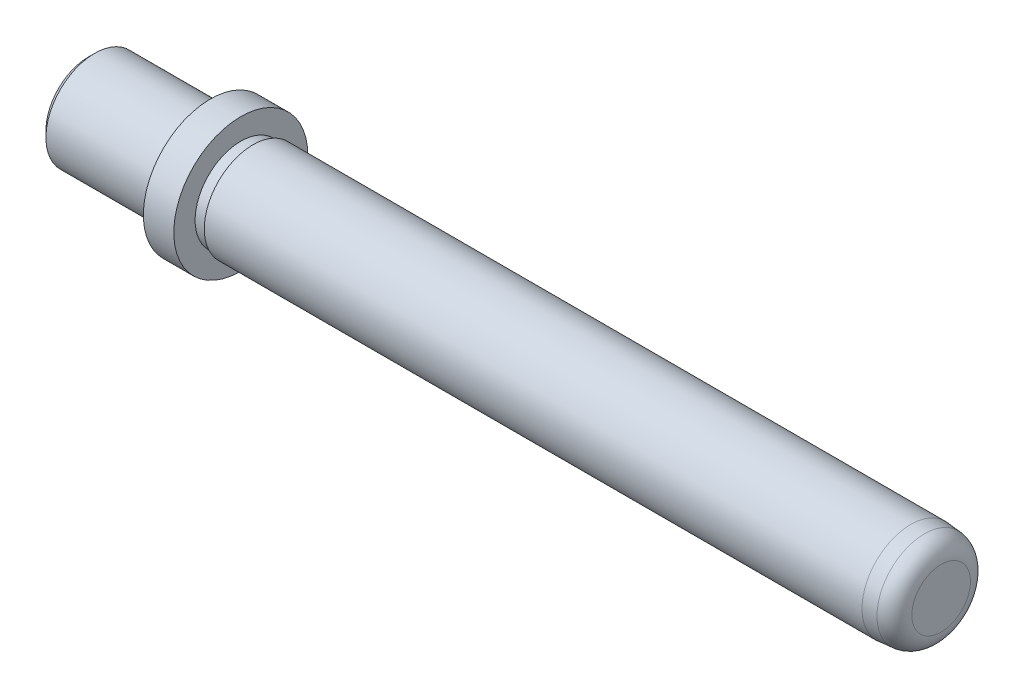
ISO-10303-21;
HEADER;
FILE_DESCRIPTION(('STEP AP214'),'2;1');
FILE_NAME('part.step','',(''),(''),'','','');
FILE_SCHEMA(('AUTOMOTIVE_DESIGN { 1 0 10303 214 1 1 1 1 }'));
ENDSEC;
DATA;
#1=APPLICATION_CONTEXT('core data for automotive mechanical design processes');
#2=APPLICATION_PROTOCOL_DEFINITION('international standard','automotive_design',2000,#1);
#3=PRODUCT_CONTEXT('',#1,'mechanical');
#4=PRODUCT('Part','Part','',(#3));
#5=PRODUCT_RELATED_PRODUCT_CATEGORY('part','',(#4));
#6=PRODUCT_DEFINITION_FORMATION('','',#4);
#7=PRODUCT_DEFINITION_CONTEXT('part definition',#1,'design');
#8=PRODUCT_DEFINITION('design','',#6,#7);
#9=PRODUCT_DEFINITION_SHAPE('','',#8);
#10=(LENGTH_UNIT() NAMED_UNIT(*) SI_UNIT(.MILLI.,.METRE.));
#11=(NAMED_UNIT(*) PLANE_ANGLE_UNIT() SI_UNIT($,.RADIAN.));
#12=(NAMED_UNIT(*) SI_UNIT($,.STERADIAN.) SOLID_ANGLE_UNIT());
#13=UNCERTAINTY_MEASURE_WITH_UNIT(LENGTH_MEASURE(1.E-05),#10,'distance_accuracy_value','');
#14=(GEOMETRIC_REPRESENTATION_CONTEXT(3) GLOBAL_UNCERTAINTY_ASSIGNED_CONTEXT((#13)) GLOBAL_UNIT_ASSIGNED_CONTEXT((#10,
#11,#12)) REPRESENTATION_CONTEXT('',''));
#15=CARTESIAN_POINT('',(0.,0.,0.));
#16=DIRECTION('',(0.,0.,1.));
#17=DIRECTION('',(1.,0.,0.));
#18=AXIS2_PLACEMENT_3D('',#15,#16,#17);
#19=CARTESIAN_POINT('',(24.3886339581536,19.5804059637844,0.));
#20=DIRECTION('',(-1.,0.,0.));
#21=DIRECTION('',(0.,0.,1.));
#22=AXIS2_PLACEMENT_3D('',#19,#20,#21);
#23=CONICAL_SURFACE('',#22,3.32349999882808,1.02974425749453);
#24=CARTESIAN_POINT('',(26.3855942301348,19.5804059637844,0.));
#25=VERTEX_POINT('',#24);
#26=VERTEX_LOOP('',#25);
#27=FACE_BOUND('',#26,.T.);
#28=CARTESIAN_POINT('',(24.3886339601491,19.5804059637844,0.));
#29=DIRECTION('',(-1.,0.,0.));
#30=DIRECTION('',(0.,0.,1.));
#31=AXIS2_PLACEMENT_3D('',#28,#29,#30);
#32=CIRCLE('',#31,3.3235);
#33=CARTESIAN_POINT('',(24.3886339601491,19.5804059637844,3.3235));
#34=VERTEX_POINT('',#33);
#35=EDGE_CURVE('E33',#34,#34,#32,.T.);
#36=ORIENTED_EDGE('',*,*,#35,.T.);
#37=EDGE_LOOP('',(#36));
#38=FACE_BOUND('',#37,.T.);
#39=ADVANCED_FACE('F17',(#27,#38),#23,.F.);
#40=CARTESIAN_POINT('',(12.3886339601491,19.5804059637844,0.));
#41=DIRECTION('',(-1.,0.,0.));
#42=DIRECTION('',(0.,0.,1.));
#43=AXIS2_PLACEMENT_3D('',#40,#41,#42);
#44=CYLINDRICAL_SURFACE('',#43,3.3235);
#45=ORIENTED_EDGE('',*,*,#35,.F.);
#46=EDGE_LOOP('',(#45));
#47=FACE_BOUND('',#46,.T.);
#48=CARTESIAN_POINT('',(0.38863396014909,19.5804059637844,0.));
#49=DIRECTION('',(-1.,0.,0.));
#50=DIRECTION('',(0.,0.,1.));
#51=AXIS2_PLACEMENT_3D('',#48,#49,#50);
#52=CIRCLE('',#51,3.3235);
#53=CARTESIAN_POINT('',(0.38863396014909,19.5804059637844,3.3235));
#54=VERTEX_POINT('',#53);
#55=EDGE_CURVE('E20',#54,#54,#52,.F.);
#56=ORIENTED_EDGE('',*,*,#55,.F.);
#57=EDGE_LOOP('',(#56));
#58=FACE_BOUND('',#57,.T.);
#59=ADVANCED_FACE('F30',(#47,#58),#44,.F.);
#60=CARTESIAN_POINT('',(0.38863396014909,23.0804059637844,0.));
#61=DIRECTION('',(-1.,0.,0.));
#62=DIRECTION('',(0.,0.,1.));
#63=AXIS2_PLACEMENT_3D('',#60,#61,#62);
#64=PLANE('',#63);
#65=ORIENTED_EDGE('',*,*,#55,.T.);
#66=EDGE_LOOP('',(#65));
#67=FACE_BOUND('',#66,.T.);
#68=CARTESIAN_POINT('',(0.388633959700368,19.5804059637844,0.));
#69=DIRECTION('',(1.,0.,0.));
#70=DIRECTION('',(0.,0.,-1.));
#71=AXIS2_PLACEMENT_3D('',#68,#69,#70);
#72=CIRCLE('',#71,7.0000000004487);
#73=CARTESIAN_POINT('',(0.388633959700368,19.5804059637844,-7.0000000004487));
#74=VERTEX_POINT('',#73);
#75=EDGE_CURVE('E37',#74,#74,#72,.T.);
#76=ORIENTED_EDGE('',*,*,#75,.F.);
#77=EDGE_LOOP('',(#76));
#78=FACE_BOUND('',#77,.T.);
#79=ADVANCED_FACE('F136',(#67,#78),#64,.T.);
#80=CARTESIAN_POINT('',(1.38863396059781,19.5804059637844,0.));
#81=DIRECTION('',(1.,0.,0.));
#82=DIRECTION('',(0.,0.,-1.));
#83=AXIS2_PLACEMENT_3D('',#80,#81,#82);
#84=CONICAL_SURFACE('',#83,7.99999999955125,0.785398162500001);
#85=ORIENTED_EDGE('',*,*,#75,.T.);
#86=EDGE_LOOP('',(#85));
#87=FACE_BOUND('',#86,.T.);
#88=CARTESIAN_POINT('',(1.38863396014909,19.5804059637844,0.));
#89=DIRECTION('',(1.,0.,0.));
#90=DIRECTION('',(0.,0.,-1.));
#91=AXIS2_PLACEMENT_3D('',#88,#89,#90);
#92=CIRCLE('',#91,7.99999999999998);
#93=CARTESIAN_POINT('',(1.38863396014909,19.5804059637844,-7.99999999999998));
#94=VERTEX_POINT('',#93);
#95=EDGE_CURVE('E66',#94,#94,#92,.T.);
#96=ORIENTED_EDGE('',*,*,#95,.F.);
#97=EDGE_LOOP('',(#96));
#98=FACE_BOUND('',#97,.T.);
#99=ADVANCED_FACE('F133',(#87,#98),#84,.T.);
#100=CARTESIAN_POINT('',(9.88863396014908,19.5804059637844,0.));
#101=DIRECTION('',(1.,0.,0.));
#102=DIRECTION('',(0.,0.,-1.));
#103=AXIS2_PLACEMENT_3D('',#100,#101,#102);
#104=CYLINDRICAL_SURFACE('',#103,7.99999999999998);
#105=ORIENTED_EDGE('',*,*,#95,.T.);
#106=EDGE_LOOP('',(#105));
#107=FACE_BOUND('',#106,.T.);
#108=CARTESIAN_POINT('',(18.3886339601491,19.5804059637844,0.));
#109=DIRECTION('',(1.,0.,0.));
#110=DIRECTION('',(0.,0.,-1.));
#111=AXIS2_PLACEMENT_3D('',#108,#109,#110);
#112=CIRCLE('',#111,7.99999999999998);
#113=CARTESIAN_POINT('',(18.3886339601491,19.5804059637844,-7.99999999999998));
#114=VERTEX_POINT('',#113);
#115=EDGE_CURVE('E64',#114,#114,#112,.T.);
#116=ORIENTED_EDGE('',*,*,#115,.F.);
#117=EDGE_LOOP('',(#116));
#118=FACE_BOUND('',#117,.T.);
#119=ADVANCED_FACE('F129',(#107,#118),#104,.T.);
#120=CARTESIAN_POINT('',(18.3886339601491,27.3304059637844,0.));
#121=DIRECTION('',(1.,0.,0.));
#122=DIRECTION('',(0.,0.,-1.));
#123=AXIS2_PLACEMENT_3D('',#120,#121,#122);
#124=PLANE('',#123);
#125=CARTESIAN_POINT('',(18.3886339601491,19.5804059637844,0.));
#126=DIRECTION('',(1.,0.,0.));
#127=DIRECTION('',(0.,0.,-1.));
#128=AXIS2_PLACEMENT_3D('',#125,#126,#127);
#129=CIRCLE('',#128,7.5);
#130=CARTESIAN_POINT('',(18.3886339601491,19.5804059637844,-7.5));
#131=VERTEX_POINT('',#130);
#132=EDGE_CURVE('E61',#131,#131,#129,.T.);
#133=ORIENTED_EDGE('',*,*,#132,.F.);
#134=EDGE_LOOP('',(#133));
#135=FACE_BOUND('',#134,.T.);
#136=ORIENTED_EDGE('',*,*,#115,.T.);
#137=EDGE_LOOP('',(#136));
#138=FACE_BOUND('',#137,.T.);
#139=ADVANCED_FACE('F125',(#135,#138),#124,.T.);
#140=CARTESIAN_POINT('',(19.3886339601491,19.5804059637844,0.));
#141=DIRECTION('',(1.,0.,0.));
#142=DIRECTION('',(0.,0.,-1.));
#143=AXIS2_PLACEMENT_3D('',#140,#141,#142);
#144=CYLINDRICAL_SURFACE('',#143,7.5);
#145=ORIENTED_EDGE('',*,*,#132,.T.);
#146=EDGE_LOOP('',(#145));
#147=FACE_BOUND('',#146,.T.);
#148=CARTESIAN_POINT('',(20.3886339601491,19.5804059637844,0.));
#149=DIRECTION('',(1.,0.,0.));
#150=DIRECTION('',(0.,0.,-1.));
#151=AXIS2_PLACEMENT_3D('',#148,#149,#150);
#152=CIRCLE('',#151,7.5);
#153=CARTESIAN_POINT('',(20.3886339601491,19.5804059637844,-7.5));
#154=VERTEX_POINT('',#153);
#155=EDGE_CURVE('E58',#154,#154,#152,.T.);
#156=ORIENTED_EDGE('',*,*,#155,.F.);
#157=EDGE_LOOP('',(#156));
#158=FACE_BOUND('',#157,.T.);
#159=ADVANCED_FACE('F121',(#147,#158),#144,.T.);
#160=CARTESIAN_POINT('',(20.3886339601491,28.8304059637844,0.));
#161=DIRECTION('',(-1.,0.,0.));
#162=DIRECTION('',(0.,0.,1.));
#163=AXIS2_PLACEMENT_3D('',#160,#161,#162);
#164=PLANE('',#163);
#165=ORIENTED_EDGE('',*,*,#155,.T.);
#166=EDGE_LOOP('',(#165));
#167=FACE_BOUND('',#166,.T.);
#168=CARTESIAN_POINT('',(20.3886339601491,19.5804059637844,0.));
#169=DIRECTION('',(1.,0.,0.));
#170=DIRECTION('',(0.,0.,-1.));
#171=AXIS2_PLACEMENT_3D('',#168,#169,#170);
#172=CIRCLE('',#171,11.);
#173=CARTESIAN_POINT('',(20.3886339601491,19.5804059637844,-11.));
#174=VERTEX_POINT('',#173);
#175=EDGE_CURVE('E55',#174,#174,#172,.T.);
#176=ORIENTED_EDGE('',*,*,#175,.F.);
#177=EDGE_LOOP('',(#176));
#178=FACE_BOUND('',#177,.T.);
#179=ADVANCED_FACE('F117',(#167,#178),#164,.T.);
#180=CARTESIAN_POINT('',(22.8886339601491,19.5804059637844,0.));
#181=DIRECTION('',(1.,0.,0.));
#182=DIRECTION('',(0.,0.,-1.));
#183=AXIS2_PLACEMENT_3D('',#180,#181,#182);
#184=CYLINDRICAL_SURFACE('',#183,11.);
#185=ORIENTED_EDGE('',*,*,#175,.T.);
#186=EDGE_LOOP('',(#185));
#187=FACE_BOUND('',#186,.T.);
#188=CARTESIAN_POINT('',(25.3886339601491,19.5804059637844,0.));
#189=DIRECTION('',(1.,0.,0.));
#190=DIRECTION('',(0.,0.,-1.));
#191=AXIS2_PLACEMENT_3D('',#188,#189,#190);
#192=CIRCLE('',#191,11.);
#193=CARTESIAN_POINT('',(25.3886339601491,19.5804059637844,-11.));
#194=VERTEX_POINT('',#193);
#195=EDGE_CURVE('E52',#194,#194,#192,.T.);
#196=ORIENTED_EDGE('',*,*,#195,.F.);
#197=EDGE_LOOP('',(#196));
#198=FACE_BOUND('',#197,.T.);
#199=ADVANCED_FACE('F114',(#187,#198),#184,.T.);
#200=CARTESIAN_POINT('',(140.388633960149,21.9871875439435,0.));
#201=DIRECTION('',(1.,0.,0.));
#202=DIRECTION('',(0.,0.,-1.));
#203=AXIS2_PLACEMENT_3D('',#200,#201,#202);
#204=PLANE('',#203);
#205=CARTESIAN_POINT('',(140.388633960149,19.5804059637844,0.));
#206=DIRECTION('',(-1.,0.,0.));
#207=DIRECTION('',(0.,1.,0.));
#208=AXIS2_PLACEMENT_3D('',#205,#206,#207);
#209=CIRCLE('',#208,4.81356316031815);
#210=CARTESIAN_POINT('',(140.388633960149,24.3939691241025,0.));
#211=VERTEX_POINT('',#210);
#212=EDGE_CURVE('E51',#211,#211,#209,.T.);
#213=ORIENTED_EDGE('',*,*,#212,.F.);
#214=EDGE_LOOP('',(#213));
#215=FACE_BOUND('',#214,.T.);
#216=ADVANCED_FACE('F105',(#215),#204,.T.);
#217=CARTESIAN_POINT('',(25.3886339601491,28.8304059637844,0.));
#218=DIRECTION('',(1.,0.,0.));
#219=DIRECTION('',(0.,0.,-1.));
#220=AXIS2_PLACEMENT_3D('',#217,#218,#219);
#221=PLANE('',#220);
#222=CARTESIAN_POINT('',(25.3886339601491,19.5804059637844,0.));
#223=DIRECTION('',(1.,0.,0.));
#224=DIRECTION('',(0.,0.,-1.));
#225=AXIS2_PLACEMENT_3D('',#222,#223,#224);
#226=CIRCLE('',#225,7.5);
#227=CARTESIAN_POINT('',(25.3886339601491,19.5804059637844,-7.5));
#228=VERTEX_POINT('',#227);
#229=EDGE_CURVE('E48',#228,#228,#226,.T.);
#230=ORIENTED_EDGE('',*,*,#229,.F.);
#231=EDGE_LOOP('',(#230));
#232=FACE_BOUND('',#231,.T.);
#233=ORIENTED_EDGE('',*,*,#195,.T.);
#234=EDGE_LOOP('',(#233));
#235=FACE_BOUND('',#234,.T.);
#236=ADVANCED_FACE('F92',(#232,#235),#221,.T.);
#237=CARTESIAN_POINT('',(137.388633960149,19.5804059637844,0.));
#238=DIRECTION('',(1.,0.,0.));
#239=DIRECTION('',(0.,0.,-1.));
#240=AXIS2_PLACEMENT_3D('',#237,#238,#239);
#241=TOROIDAL_SURFACE('',#240,4.81356316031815,3.);
#242=CARTESIAN_POINT('',(137.650101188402,19.5804059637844,0.));
#243=DIRECTION('',(-1.,0.,0.));
#244=DIRECTION('',(0.,1.,0.));
#245=AXIS2_PLACEMENT_3D('',#242,#243,#244);
#246=CIRCLE('',#245,7.80214725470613);
#247=CARTESIAN_POINT('',(137.650101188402,27.3825532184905,0.));
#248=VERTEX_POINT('',#247);
#249=EDGE_CURVE('E47',#248,#248,#246,.T.);
#250=ORIENTED_EDGE('',*,*,#249,.F.);
#251=EDGE_LOOP('',(#250));
#252=FACE_BOUND('',#251,.T.);
#253=ORIENTED_EDGE('',*,*,#212,.T.);
#254=EDGE_LOOP('',(#253));
#255=FACE_BOUND('',#254,.T.);
#256=ADVANCED_FACE('F80',(#252,#255),#241,.T.);
#257=CARTESIAN_POINT('',(26.3886339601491,19.5804059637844,0.));
#258=DIRECTION('',(1.,0.,0.));
#259=DIRECTION('',(0.,0.,-1.));
#260=AXIS2_PLACEMENT_3D('',#257,#258,#259);
#261=CYLINDRICAL_SURFACE('',#260,7.5);
#262=ORIENTED_EDGE('',*,*,#229,.T.);
#263=EDGE_LOOP('',(#262));
#264=FACE_BOUND('',#263,.T.);
#265=CARTESIAN_POINT('',(27.3886339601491,19.5804059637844,0.));
#266=DIRECTION('',(1.,0.,0.));
#267=DIRECTION('',(0.,0.,-1.));
#268=AXIS2_PLACEMENT_3D('',#265,#266,#267);
#269=CIRCLE('',#268,7.5);
#270=CARTESIAN_POINT('',(27.3886339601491,19.5804059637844,-7.5));
#271=VERTEX_POINT('',#270);
#272=EDGE_CURVE('E44',#271,#271,#269,.T.);
#273=ORIENTED_EDGE('',*,*,#272,.F.);
#274=EDGE_LOOP('',(#273));
#275=FACE_BOUND('',#274,.T.);
#276=ADVANCED_FACE('F91',(#264,#275),#261,.T.);
#277=CARTESIAN_POINT('',(135.388633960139,19.5804059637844,0.));
#278=DIRECTION('',(-1.,0.,0.));
#279=DIRECTION('',(0.,0.,1.));
#280=AXIS2_PLACEMENT_3D('',#277,#278,#279);
#281=CONICAL_SURFACE('',#280,7.99999999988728,0.0872664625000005);
#282=CARTESIAN_POINT('',(135.388633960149,19.5804059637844,0.));
#283=DIRECTION('',(1.,0.,0.));
#284=DIRECTION('',(0.,0.,-1.));
#285=AXIS2_PLACEMENT_3D('',#282,#283,#284);
#286=CIRCLE('',#285,8.00000000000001);
#287=CARTESIAN_POINT('',(135.388633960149,19.5804059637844,-8.00000000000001));
#288=VERTEX_POINT('',#287);
#289=EDGE_CURVE('E24',#288,#288,#286,.F.);
#290=ORIENTED_EDGE('',*,*,#289,.F.);
#291=EDGE_LOOP('',(#290));
#292=FACE_BOUND('',#291,.T.);
#293=ORIENTED_EDGE('',*,*,#249,.T.);
#294=EDGE_LOOP('',(#293));
#295=FACE_BOUND('',#294,.T.);
#296=ADVANCED_FACE('F152',(#292,#295),#281,.T.);
#297=CARTESIAN_POINT('',(27.3886339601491,27.3304059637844,0.));
#298=DIRECTION('',(-1.,0.,0.));
#299=DIRECTION('',(0.,0.,1.));
#300=AXIS2_PLACEMENT_3D('',#297,#298,#299);
#301=PLANE('',#300);
#302=ORIENTED_EDGE('',*,*,#272,.T.);
#303=EDGE_LOOP('',(#302));
#304=FACE_BOUND('',#303,.T.);
#305=CARTESIAN_POINT('',(27.3886339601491,19.5804059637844,0.));
#306=DIRECTION('',(1.,0.,0.));
#307=DIRECTION('',(0.,0.,-1.));
#308=AXIS2_PLACEMENT_3D('',#305,#306,#307);
#309=CIRCLE('',#308,8.00000000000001);
#310=CARTESIAN_POINT('',(27.3886339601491,19.5804059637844,-8.00000000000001));
#311=VERTEX_POINT('',#310);
#312=EDGE_CURVE('E11',#311,#311,#309,.T.);
#313=ORIENTED_EDGE('',*,*,#312,.F.);
#314=EDGE_LOOP('',(#313));
#315=FACE_BOUND('',#314,.T.);
#316=ADVANCED_FACE('F146',(#304,#315),#301,.T.);
#317=CARTESIAN_POINT('',(81.3886339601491,19.5804059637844,0.));
#318=DIRECTION('',(1.,0.,0.));
#319=DIRECTION('',(0.,0.,-1.));
#320=AXIS2_PLACEMENT_3D('',#317,#318,#319);
#321=CYLINDRICAL_SURFACE('',#320,8.00000000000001);
#322=ORIENTED_EDGE('',*,*,#312,.T.);
#323=EDGE_LOOP('',(#322));
#324=FACE_BOUND('',#323,.T.);
#325=ORIENTED_EDGE('',*,*,#289,.T.);
#326=EDGE_LOOP('',(#325));
#327=FACE_BOUND('',#326,.T.);
#328=ADVANCED_FACE('F144',(#324,#327),#321,.T.);
#329=CLOSED_SHELL('',(#39,#59,#79,#99,#119,#139,#159,#179,#199,#216,#236,#256,#276,#296,#316,#328));
#330=MANIFOLD_SOLID_BREP('B1',#329);
#331=ADVANCED_BREP_SHAPE_REPRESENTATION('',(#18,#330),#14);
#332=SHAPE_DEFINITION_REPRESENTATION(#9,#331);
ENDSEC;
END-ISO-10303-21;
